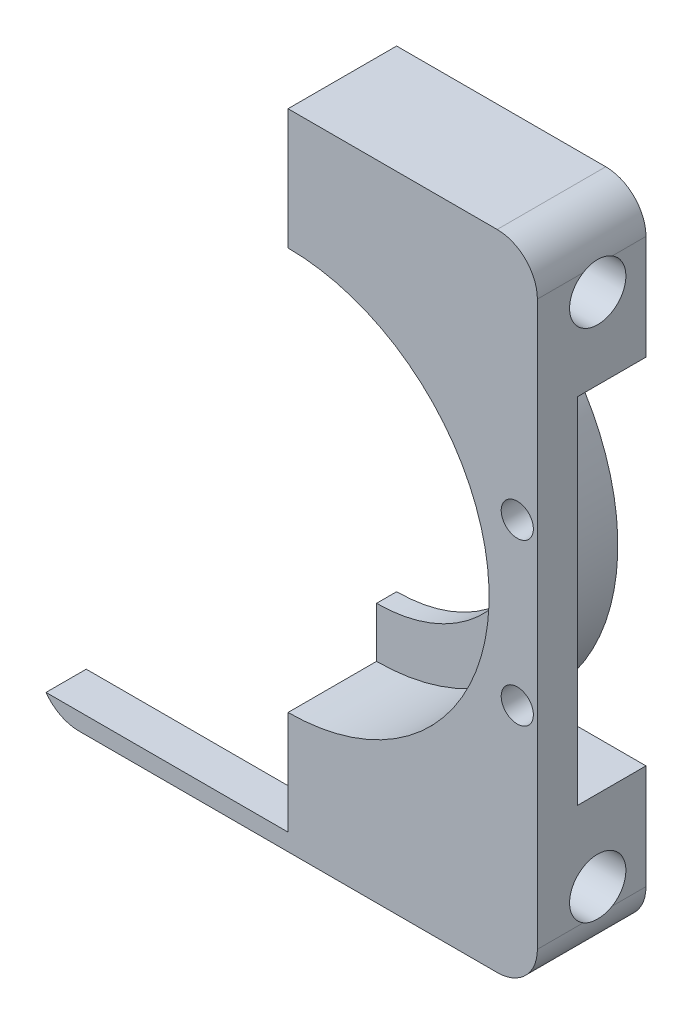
from build123d import *

# Parameters (mm, degrees)
SKETCH1_R           = 4
BOSS_EXTRUDE1_DEPTH = 10
SKETCH2_R           = 55
SKETCH2_R_2         = 50
BOSS_EXTRUDE2_DEPTH = 12
SKETCH3_R           = 55
SKETCH3_R_2         = 37.5
BOSS_EXTRUDE3_DEPTH = 5
SKETCH4_W           = 69.514185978
SKETCH4_H           = 157.372393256
CUT_EXTRUDE1_DEPTH  = 598.423649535
BOSS_EXTRUDE4_DEPTH = 17
SKETCH7_R           = 7
CUT_EXTRUDE2_DEPTH  = 598.423649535
CUT_EXTRUDE3_DEPTH  = 460.236069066


with BuildPart() as part:
    # Sketch1 → Boss-Extrude1 (new body)
    with BuildSketch(Plane(origin=(0, 0, 382.5), x_dir=(-1, 0, 0), z_dir=(0, 0, -1))):
        with BuildLine():
            Line((-52, 454.713939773), (52, 454.713939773))
            ThreePointArc((52, 454.713939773), (59.071067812, 451.785007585), (62, 444.713939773))
            Line((62, 444.713939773), (62, 304.713939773))
            ThreePointArc((62, 304.713939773), (59.071067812, 297.642871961), (52, 294.713939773))
            Line((52, 294.713939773), (-52, 294.713939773))
            ThreePointArc((-52, 294.713939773), (-59.071067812, 297.642871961), (-62, 304.713939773))
            Line((-62, 304.713939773), (-62, 444.713939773))
            ThreePointArc((-62, 444.713939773), (-59.071067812, 451.785007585), (-52, 454.713939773))
        make_face()
        with Locations(Location((-57, 394.713939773, 0), (0, 0, 90))):
            Circle(SKETCH1_R, mode=Mode.SUBTRACT)
        with Locations(Location((-57, 354.713939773, 0), (0, 0, 90))):
            Circle(SKETCH1_R, mode=Mode.SUBTRACT)
    extrude(amount=BOSS_EXTRUDE1_DEPTH)

    # Sketch2 → Boss-Extrude2 (add)
    with BuildSketch(Plane(origin=(0, 0, 372.5), x_dir=(-1, 0, 0), z_dir=(0, 0, -1))):
        with Locations(Location((0, 374.713939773, 0), (0, 0, 270))):
            Circle(SKETCH2_R)
        with Locations(Location((0, 374.713939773, 0), (0, 0, 90))):
            Circle(SKETCH2_R_2, mode=Mode.SUBTRACT)
    extrude(amount=BOSS_EXTRUDE2_DEPTH)

    # Sketch3 → Boss-Extrude3 (add)
    with BuildSketch(Plane(origin=(0, 0, 360.5), x_dir=(-1, 0, 0), z_dir=(0, 0, -1))):
        with Locations(Location((0, 374.713939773, 0), (0, 0, 270))):
            Circle(SKETCH3_R)
        with Locations(Location((0, 374.713939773, 0), (0, 0, 90))):
            Circle(SKETCH3_R_2, mode=Mode.SUBTRACT)
    extrude(amount=BOSS_EXTRUDE3_DEPTH)

    # Sketch4 → Cut-Extrude1 (cut, through all)
    with BuildSketch(Plane.ZY):
        with Locations((373.686670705, 377.634640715)):
            Rectangle(SKETCH4_W, SKETCH4_H)
    extrude(amount=CUT_EXTRUDE1_DEPTH, mode=Mode.SUBTRACT)

    # Sketch5 → Boss-Extrude4 (add)
    with BuildSketch(Plane(origin=(0, 0, 372.5), x_dir=(-1, 0, 0), z_dir=(0, 0, -1))):
        with BuildLine():
            Line((-62, 330.713939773), (-33, 330.713939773))
            ThreePointArc((-33, 330.713939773), (-17.392527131, 322.53635838), (0, 319.713939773))
            Line((0, 319.713939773), (0, 294.713939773))
            Line((0, 294.713939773), (-52, 294.713939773))
            ThreePointArc((-52, 294.713939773), (-59.071067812, 297.642871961), (-62, 304.713939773))
            Line((-62, 304.713939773), (-62, 330.713939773))
        make_face()
    boss_extrude4 = extrude(amount=BOSS_EXTRUDE4_DEPTH)

    # Mirror1: Boss-Extrude4 across plane
    add(boss_extrude4.mirror(Plane.ZX.offset(374.713939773)))

    # Sketch7 → Cut-Extrude2 (cut, through all)
    with BuildSketch(Plane.ZY):
        with Locations(Location((367.5, 438.713939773, 0), (0, 0, 270))):
            Circle(SKETCH7_R)
        with Locations(Location((367.5, 310.713939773, 0), (0, 0, 238.997280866))):
            Circle(SKETCH7_R)
    extrude(amount=-CUT_EXTRUDE2_DEPTH, mode=Mode.SUBTRACT)

    # Sketch10 → Cut-Extrude3 (cut, through all)
    with BuildSketch(Plane(origin=(0, 0, 372.5), x_dir=(-1, 0, 0), z_dir=(0, 0, -1))):
        with BuildLine():
            Line((0, 324.713939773), (0, 424.713939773))
            ThreePointArc((0, 424.713939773), (-50, 374.713939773), (0, 324.713939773))
        make_face()
    extrude(amount=-CUT_EXTRUDE3_DEPTH, mode=Mode.SUBTRACT)


solid = part.part
